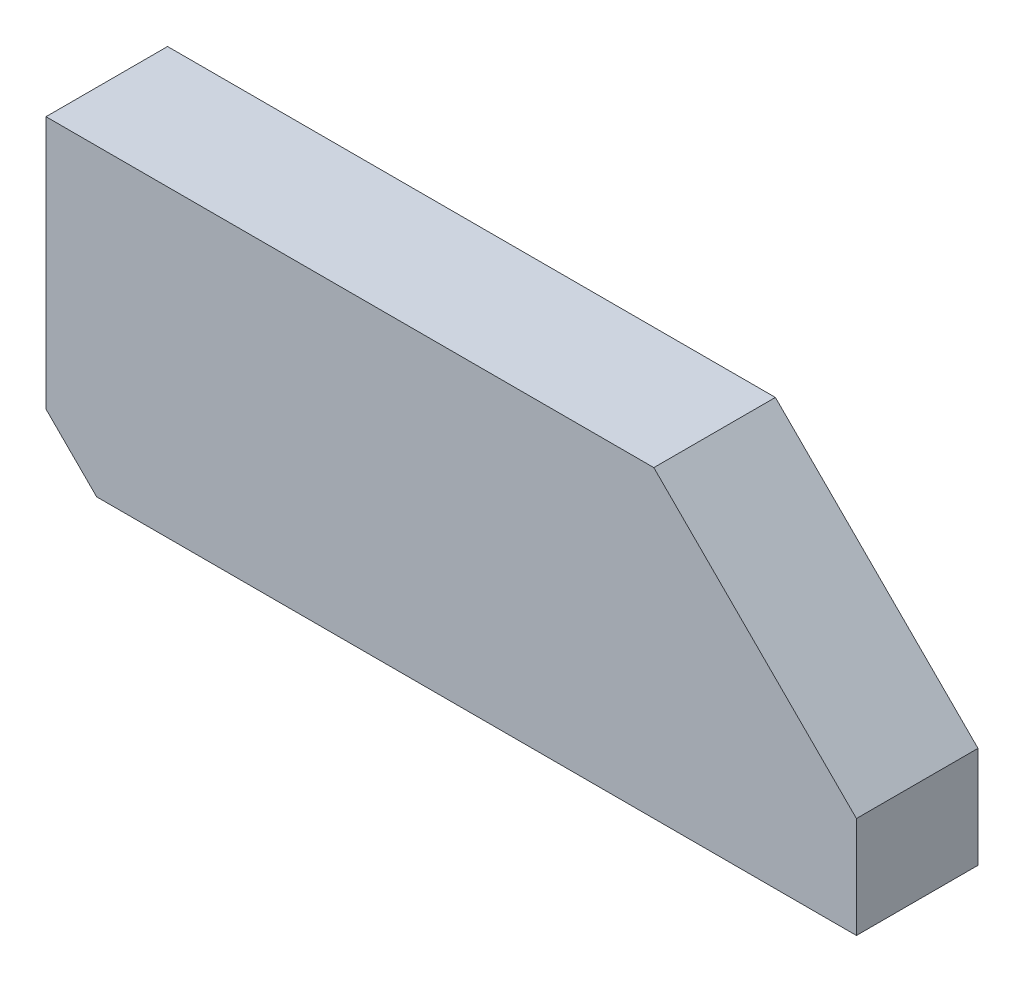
ISO-10303-21;
HEADER;
FILE_DESCRIPTION(('STEP AP214'),'2;1');
FILE_NAME('part.step','',(''),(''),'','','');
FILE_SCHEMA(('AUTOMOTIVE_DESIGN { 1 0 10303 214 1 1 1 1 }'));
ENDSEC;
DATA;
#1=APPLICATION_CONTEXT('core data for automotive mechanical design processes');
#2=APPLICATION_PROTOCOL_DEFINITION('international standard','automotive_design',2000,#1);
#3=PRODUCT_CONTEXT('',#1,'mechanical');
#4=PRODUCT('Part','Part','',(#3));
#5=PRODUCT_RELATED_PRODUCT_CATEGORY('part','',(#4));
#6=PRODUCT_DEFINITION_FORMATION('','',#4);
#7=PRODUCT_DEFINITION_CONTEXT('part definition',#1,'design');
#8=PRODUCT_DEFINITION('design','',#6,#7);
#9=PRODUCT_DEFINITION_SHAPE('','',#8);
#10=(LENGTH_UNIT() NAMED_UNIT(*) SI_UNIT(.MILLI.,.METRE.));
#11=(NAMED_UNIT(*) PLANE_ANGLE_UNIT() SI_UNIT($,.RADIAN.));
#12=(NAMED_UNIT(*) SI_UNIT($,.STERADIAN.) SOLID_ANGLE_UNIT());
#13=UNCERTAINTY_MEASURE_WITH_UNIT(LENGTH_MEASURE(1.E-05),#10,'distance_accuracy_value','');
#14=(GEOMETRIC_REPRESENTATION_CONTEXT(3) GLOBAL_UNCERTAINTY_ASSIGNED_CONTEXT((#13)) GLOBAL_UNIT_ASSIGNED_CONTEXT((#10,
#11,#12)) REPRESENTATION_CONTEXT('',''));
#15=CARTESIAN_POINT('',(0.,0.,0.));
#16=DIRECTION('',(0.,0.,1.));
#17=DIRECTION('',(1.,0.,0.));
#18=AXIS2_PLACEMENT_3D('',#15,#16,#17);
#19=CARTESIAN_POINT('',(0.,0.,-12.));
#20=DIRECTION('',(-1.,0.,0.));
#21=DIRECTION('',(0.,-1.,0.));
#22=AXIS2_PLACEMENT_3D('',#19,#20,#21);
#23=PLANE('',#22);
#24=DIRECTION('',(0.,-1.,0.));
#25=VECTOR('',#24,1.);
#26=CARTESIAN_POINT('',(0.,0.,0.));
#27=LINE('',#26,#25);
#28=CARTESIAN_POINT('',(0.,0.,0.));
#29=VERTEX_POINT('',#28);
#30=CARTESIAN_POINT('',(0.,-25.,0.));
#31=VERTEX_POINT('',#30);
#32=EDGE_CURVE('E80',#29,#31,#27,.T.);
#33=ORIENTED_EDGE('',*,*,#32,.F.);
#34=DIRECTION('',(0.,0.,1.));
#35=VECTOR('',#34,1.);
#36=CARTESIAN_POINT('',(0.,0.,-12.));
#37=LINE('',#36,#35);
#38=CARTESIAN_POINT('',(0.,0.,-12.));
#39=VERTEX_POINT('',#38);
#40=EDGE_CURVE('E11',#39,#29,#37,.T.);
#41=ORIENTED_EDGE('',*,*,#40,.F.);
#42=DIRECTION('',(0.,-1.,0.));
#43=VECTOR('',#42,1.);
#44=CARTESIAN_POINT('',(0.,0.,-12.));
#45=LINE('',#44,#43);
#46=CARTESIAN_POINT('',(0.,-25.,-12.));
#47=VERTEX_POINT('',#46);
#48=EDGE_CURVE('E82',#39,#47,#45,.T.);
#49=ORIENTED_EDGE('',*,*,#48,.T.);
#50=DIRECTION('',(0.,0.,1.));
#51=VECTOR('',#50,1.);
#52=CARTESIAN_POINT('',(0.,-25.,-12.));
#53=LINE('',#52,#51);
#54=EDGE_CURVE('E31',#47,#31,#53,.T.);
#55=ORIENTED_EDGE('',*,*,#54,.T.);
#56=EDGE_LOOP('',(#33,#41,#49,#55));
#57=FACE_BOUND('',#56,.T.);
#58=ADVANCED_FACE('F28',(#57),#23,.T.);
#59=CARTESIAN_POINT('',(0.,0.,-12.));
#60=DIRECTION('',(0.,1.,0.));
#61=DIRECTION('',(0.,0.,1.));
#62=AXIS2_PLACEMENT_3D('',#59,#60,#61);
#63=PLANE('',#62);
#64=DIRECTION('',(-1.,0.,0.));
#65=VECTOR('',#64,1.);
#66=CARTESIAN_POINT('',(0.,0.,0.));
#67=LINE('',#66,#65);
#68=CARTESIAN_POINT('',(60.,0.,0.));
#69=VERTEX_POINT('',#68);
#70=EDGE_CURVE('E98',#69,#29,#67,.T.);
#71=ORIENTED_EDGE('',*,*,#70,.F.);
#72=DIRECTION('',(0.,0.,1.));
#73=VECTOR('',#72,1.);
#74=CARTESIAN_POINT('',(60.,0.,-12.));
#75=LINE('',#74,#73);
#76=CARTESIAN_POINT('',(60.,0.,-12.));
#77=VERTEX_POINT('',#76);
#78=EDGE_CURVE('E36',#77,#69,#75,.T.);
#79=ORIENTED_EDGE('',*,*,#78,.F.);
#80=DIRECTION('',(-1.,0.,0.));
#81=VECTOR('',#80,1.);
#82=CARTESIAN_POINT('',(0.,0.,-12.));
#83=LINE('',#82,#81);
#84=EDGE_CURVE('E87',#77,#39,#83,.T.);
#85=ORIENTED_EDGE('',*,*,#84,.T.);
#86=ORIENTED_EDGE('',*,*,#40,.T.);
#87=EDGE_LOOP('',(#71,#79,#85,#86));
#88=FACE_BOUND('',#87,.T.);
#89=ADVANCED_FACE('F133',(#88),#63,.T.);
#90=CARTESIAN_POINT('',(60.,0.,-12.));
#91=DIRECTION('',(0.707106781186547,0.707106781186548,0.));
#92=DIRECTION('',(-0.707106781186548,0.707106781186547,0.));
#93=AXIS2_PLACEMENT_3D('',#90,#91,#92);
#94=PLANE('',#93);
#95=DIRECTION('',(-0.707106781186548,0.707106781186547,0.));
#96=VECTOR('',#95,1.);
#97=CARTESIAN_POINT('',(60.,0.,0.));
#98=LINE('',#97,#96);
#99=CARTESIAN_POINT('',(80.,-20.,0.));
#100=VERTEX_POINT('',#99);
#101=EDGE_CURVE('E105',#100,#69,#98,.T.);
#102=ORIENTED_EDGE('',*,*,#101,.F.);
#103=DIRECTION('',(0.,0.,1.));
#104=VECTOR('',#103,1.);
#105=CARTESIAN_POINT('',(80.,-20.,-12.));
#106=LINE('',#105,#104);
#107=CARTESIAN_POINT('',(80.,-20.,-12.));
#108=VERTEX_POINT('',#107);
#109=EDGE_CURVE('E121',#108,#100,#106,.T.);
#110=ORIENTED_EDGE('',*,*,#109,.F.);
#111=DIRECTION('',(-0.707106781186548,0.707106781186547,0.));
#112=VECTOR('',#111,1.);
#113=CARTESIAN_POINT('',(60.,0.,-12.));
#114=LINE('',#113,#112);
#115=EDGE_CURVE('E117',#108,#77,#114,.T.);
#116=ORIENTED_EDGE('',*,*,#115,.T.);
#117=ORIENTED_EDGE('',*,*,#78,.T.);
#118=EDGE_LOOP('',(#102,#110,#116,#117));
#119=FACE_BOUND('',#118,.T.);
#120=ADVANCED_FACE('F138',(#119),#94,.T.);
#121=CARTESIAN_POINT('',(80.,-20.,-12.));
#122=DIRECTION('',(1.,0.,0.));
#123=DIRECTION('',(0.,1.,0.));
#124=AXIS2_PLACEMENT_3D('',#121,#122,#123);
#125=PLANE('',#124);
#126=DIRECTION('',(0.,1.,0.));
#127=VECTOR('',#126,1.);
#128=CARTESIAN_POINT('',(80.,-20.,0.));
#129=LINE('',#128,#127);
#130=CARTESIAN_POINT('',(80.,-30.,0.));
#131=VERTEX_POINT('',#130);
#132=EDGE_CURVE('E102',#131,#100,#129,.T.);
#133=ORIENTED_EDGE('',*,*,#132,.F.);
#134=DIRECTION('',(0.,0.,1.));
#135=VECTOR('',#134,1.);
#136=CARTESIAN_POINT('',(80.,-30.,-12.));
#137=LINE('',#136,#135);
#138=CARTESIAN_POINT('',(80.,-30.,-12.));
#139=VERTEX_POINT('',#138);
#140=EDGE_CURVE('E123',#139,#131,#137,.T.);
#141=ORIENTED_EDGE('',*,*,#140,.F.);
#142=DIRECTION('',(0.,1.,0.));
#143=VECTOR('',#142,1.);
#144=CARTESIAN_POINT('',(80.,-20.,-12.));
#145=LINE('',#144,#143);
#146=EDGE_CURVE('E114',#139,#108,#145,.T.);
#147=ORIENTED_EDGE('',*,*,#146,.T.);
#148=ORIENTED_EDGE('',*,*,#109,.T.);
#149=EDGE_LOOP('',(#133,#141,#147,#148));
#150=FACE_BOUND('',#149,.T.);
#151=ADVANCED_FACE('F130',(#150),#125,.T.);
#152=CARTESIAN_POINT('',(5.,-30.,-12.));
#153=DIRECTION('',(0.,-1.,0.));
#154=DIRECTION('',(0.,0.,-1.));
#155=AXIS2_PLACEMENT_3D('',#152,#153,#154);
#156=PLANE('',#155);
#157=DIRECTION('',(1.,0.,0.));
#158=VECTOR('',#157,1.);
#159=CARTESIAN_POINT('',(5.,-30.,0.));
#160=LINE('',#159,#158);
#161=CARTESIAN_POINT('',(5.,-30.,0.));
#162=VERTEX_POINT('',#161);
#163=EDGE_CURVE('E94',#162,#131,#160,.T.);
#164=ORIENTED_EDGE('',*,*,#163,.F.);
#165=DIRECTION('',(0.,0.,1.));
#166=VECTOR('',#165,1.);
#167=CARTESIAN_POINT('',(5.,-30.,-12.));
#168=LINE('',#167,#166);
#169=CARTESIAN_POINT('',(5.,-30.,-12.));
#170=VERTEX_POINT('',#169);
#171=EDGE_CURVE('E86',#170,#162,#168,.T.);
#172=ORIENTED_EDGE('',*,*,#171,.F.);
#173=DIRECTION('',(1.,0.,0.));
#174=VECTOR('',#173,1.);
#175=CARTESIAN_POINT('',(5.,-30.,-12.));
#176=LINE('',#175,#174);
#177=EDGE_CURVE('E111',#170,#139,#176,.T.);
#178=ORIENTED_EDGE('',*,*,#177,.T.);
#179=ORIENTED_EDGE('',*,*,#140,.T.);
#180=EDGE_LOOP('',(#164,#172,#178,#179));
#181=FACE_BOUND('',#180,.T.);
#182=ADVANCED_FACE('F126',(#181),#156,.T.);
#183=CARTESIAN_POINT('',(0.,-25.,-12.));
#184=DIRECTION('',(-0.707106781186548,-0.707106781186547,0.));
#185=DIRECTION('',(0.707106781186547,-0.707106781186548,0.));
#186=AXIS2_PLACEMENT_3D('',#183,#184,#185);
#187=PLANE('',#186);
#188=DIRECTION('',(0.707106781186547,-0.707106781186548,0.));
#189=VECTOR('',#188,1.);
#190=CARTESIAN_POINT('',(0.,-25.,0.));
#191=LINE('',#190,#189);
#192=EDGE_CURVE('E89',#31,#162,#191,.T.);
#193=ORIENTED_EDGE('',*,*,#192,.F.);
#194=ORIENTED_EDGE('',*,*,#54,.F.);
#195=DIRECTION('',(0.707106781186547,-0.707106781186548,0.));
#196=VECTOR('',#195,1.);
#197=CARTESIAN_POINT('',(0.,-25.,-12.));
#198=LINE('',#197,#196);
#199=EDGE_CURVE('E109',#47,#170,#198,.T.);
#200=ORIENTED_EDGE('',*,*,#199,.T.);
#201=ORIENTED_EDGE('',*,*,#171,.T.);
#202=EDGE_LOOP('',(#193,#194,#200,#201));
#203=FACE_BOUND('',#202,.T.);
#204=ADVANCED_FACE('F90',(#203),#187,.T.);
#205=CARTESIAN_POINT('',(0.,-30.,-12.));
#206=DIRECTION('',(0.,0.,1.));
#207=DIRECTION('',(1.,0.,0.));
#208=AXIS2_PLACEMENT_3D('',#205,#206,#207);
#209=PLANE('',#208);
#210=ORIENTED_EDGE('',*,*,#48,.F.);
#211=ORIENTED_EDGE('',*,*,#84,.F.);
#212=ORIENTED_EDGE('',*,*,#115,.F.);
#213=ORIENTED_EDGE('',*,*,#146,.F.);
#214=ORIENTED_EDGE('',*,*,#177,.F.);
#215=ORIENTED_EDGE('',*,*,#199,.F.);
#216=EDGE_LOOP('',(#210,#211,#212,#213,#214,#215));
#217=FACE_BOUND('',#216,.T.);
#218=ADVANCED_FACE('F137',(#217),#209,.F.);
#219=CARTESIAN_POINT('',(0.,-30.,0.));
#220=DIRECTION('',(0.,0.,1.));
#221=DIRECTION('',(1.,0.,0.));
#222=AXIS2_PLACEMENT_3D('',#219,#220,#221);
#223=PLANE('',#222);
#224=ORIENTED_EDGE('',*,*,#32,.T.);
#225=ORIENTED_EDGE('',*,*,#192,.T.);
#226=ORIENTED_EDGE('',*,*,#163,.T.);
#227=ORIENTED_EDGE('',*,*,#132,.T.);
#228=ORIENTED_EDGE('',*,*,#101,.T.);
#229=ORIENTED_EDGE('',*,*,#70,.T.);
#230=EDGE_LOOP('',(#224,#225,#226,#227,#228,#229));
#231=FACE_BOUND('',#230,.T.);
#232=ADVANCED_FACE('F96',(#231),#223,.T.);
#233=CLOSED_SHELL('',(#58,#89,#120,#151,#182,#204,#218,#232));
#234=MANIFOLD_SOLID_BREP('B2',#233);
#235=ADVANCED_BREP_SHAPE_REPRESENTATION('',(#18,#234),#14);
#236=SHAPE_DEFINITION_REPRESENTATION(#9,#235);
ENDSEC;
END-ISO-10303-21;
